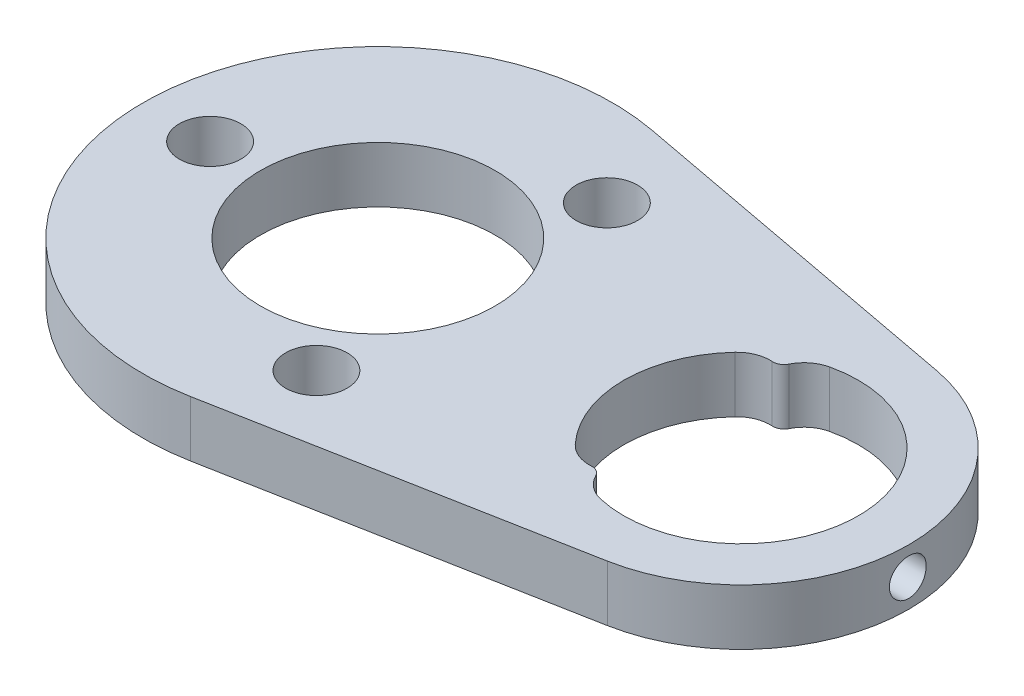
ISO-10303-21;
HEADER;
FILE_DESCRIPTION(('STEP AP214'),'2;1');
FILE_NAME('part.step','',(''),(''),'','','');
FILE_SCHEMA(('AUTOMOTIVE_DESIGN { 1 0 10303 214 1 1 1 1 }'));
ENDSEC;
DATA;
#1=APPLICATION_CONTEXT('core data for automotive mechanical design processes');
#2=APPLICATION_PROTOCOL_DEFINITION('international standard','automotive_design',2000,#1);
#3=PRODUCT_CONTEXT('',#1,'mechanical');
#4=PRODUCT('Part','Part','',(#3));
#5=PRODUCT_RELATED_PRODUCT_CATEGORY('part','',(#4));
#6=PRODUCT_DEFINITION_FORMATION('','',#4);
#7=PRODUCT_DEFINITION_CONTEXT('part definition',#1,'design');
#8=PRODUCT_DEFINITION('design','',#6,#7);
#9=PRODUCT_DEFINITION_SHAPE('','',#8);
#10=(LENGTH_UNIT() NAMED_UNIT(*) SI_UNIT(.MILLI.,.METRE.));
#11=(NAMED_UNIT(*) PLANE_ANGLE_UNIT() SI_UNIT($,.RADIAN.));
#12=(NAMED_UNIT(*) SI_UNIT($,.STERADIAN.) SOLID_ANGLE_UNIT());
#13=UNCERTAINTY_MEASURE_WITH_UNIT(LENGTH_MEASURE(1.E-05),#10,'distance_accuracy_value','');
#14=(GEOMETRIC_REPRESENTATION_CONTEXT(3) GLOBAL_UNCERTAINTY_ASSIGNED_CONTEXT((#13)) GLOBAL_UNIT_ASSIGNED_CONTEXT((#10,
#11,#12)) REPRESENTATION_CONTEXT('',''));
#15=CARTESIAN_POINT('',(0.,0.,0.));
#16=DIRECTION('',(0.,0.,1.));
#17=DIRECTION('',(1.,0.,0.));
#18=AXIS2_PLACEMENT_3D('',#15,#16,#17);
#19=CARTESIAN_POINT('',(0.,2.5,0.));
#20=DIRECTION('',(0.,1.,0.));
#21=DIRECTION('',(0.,0.,1.));
#22=AXIS2_PLACEMENT_3D('',#19,#20,#21);
#23=PLANE('',#22);
#24=CARTESIAN_POINT('',(7.49999999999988,2.5,-12.9903810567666));
#25=DIRECTION('',(0.,1.,0.));
#26=DIRECTION('',(0.,0.,1.));
#27=AXIS2_PLACEMENT_3D('',#24,#25,#26);
#28=CIRCLE('',#27,2.75);
#29=CARTESIAN_POINT('',(7.49999999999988,2.5,-10.2403810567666));
#30=VERTEX_POINT('',#29);
#31=EDGE_CURVE('E365',#30,#30,#28,.T.);
#32=ORIENTED_EDGE('',*,*,#31,.F.);
#33=EDGE_LOOP('',(#32));
#34=FACE_BOUND('',#33,.T.);
#35=CARTESIAN_POINT('',(7.50000000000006,2.5,12.9903810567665));
#36=DIRECTION('',(0.,1.,0.));
#37=DIRECTION('',(0.,0.,1.));
#38=AXIS2_PLACEMENT_3D('',#35,#36,#37);
#39=CIRCLE('',#38,2.75);
#40=CARTESIAN_POINT('',(7.50000000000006,2.5,15.7403810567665));
#41=VERTEX_POINT('',#40);
#42=EDGE_CURVE('E373',#41,#41,#39,.T.);
#43=ORIENTED_EDGE('',*,*,#42,.F.);
#44=EDGE_LOOP('',(#43));
#45=FACE_BOUND('',#44,.T.);
#46=CARTESIAN_POINT('',(-15.,2.5,0.));
#47=DIRECTION('',(0.,1.,0.));
#48=DIRECTION('',(0.,0.,1.));
#49=AXIS2_PLACEMENT_3D('',#46,#47,#48);
#50=CIRCLE('',#49,2.75);
#51=CARTESIAN_POINT('',(-15.,2.5,2.75));
#52=VERTEX_POINT('',#51);
#53=EDGE_CURVE('E379',#52,#52,#50,.T.);
#54=ORIENTED_EDGE('',*,*,#53,.F.);
#55=EDGE_LOOP('',(#54));
#56=FACE_BOUND('',#55,.T.);
#57=CARTESIAN_POINT('',(27.25,2.5,9.09326673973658));
#58=DIRECTION('',(0.,-1.,0.));
#59=DIRECTION('',(0.,0.,1.));
#60=AXIS2_PLACEMENT_3D('',#57,#58,#59);
#61=CIRCLE('',#60,1.);
#62=CARTESIAN_POINT('',(27.1879531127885,2.5,8.09519350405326));
#63=VERTEX_POINT('',#62);
#64=CARTESIAN_POINT('',(28.1453802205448,2.5,8.64796430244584));
#65=VERTEX_POINT('',#64);
#66=EDGE_CURVE('E249',#63,#65,#61,.T.);
#67=ORIENTED_EDGE('',*,*,#66,.F.);
#68=CARTESIAN_POINT('',(27.001812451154,2.5,5.10097379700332));
#69=DIRECTION('',(0.,1.,0.));
#70=DIRECTION('',(0.,0.,1.));
#71=AXIS2_PLACEMENT_3D('',#68,#69,#70);
#72=CIRCLE('',#71,3.);
#73=CARTESIAN_POINT('',(24.8025374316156,2.5,7.14136331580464));
#74=VERTEX_POINT('',#73);
#75=EDGE_CURVE('E65',#63,#74,#72,.F.);
#76=ORIENTED_EDGE('',*,*,#75,.T.);
#77=CARTESIAN_POINT('',(32.5,2.5,0.));
#78=DIRECTION('',(0.,1.,0.));
#79=DIRECTION('',(0.,0.,1.));
#80=AXIS2_PLACEMENT_3D('',#77,#78,#79);
#81=CIRCLE('',#80,10.5);
#82=CARTESIAN_POINT('',(24.8025374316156,2.5,-7.14136331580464));
#83=VERTEX_POINT('',#82);
#84=EDGE_CURVE('E238',#83,#74,#81,.T.);
#85=ORIENTED_EDGE('',*,*,#84,.F.);
#86=CARTESIAN_POINT('',(27.001812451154,2.5,-5.10097379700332));
#87=DIRECTION('',(0.,1.,0.));
#88=DIRECTION('',(0.,0.,1.));
#89=AXIS2_PLACEMENT_3D('',#86,#87,#88);
#90=CIRCLE('',#89,3.);
#91=CARTESIAN_POINT('',(27.1879531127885,2.5,-8.09519350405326));
#92=VERTEX_POINT('',#91);
#93=EDGE_CURVE('E211',#83,#92,#90,.F.);
#94=ORIENTED_EDGE('',*,*,#93,.T.);
#95=CARTESIAN_POINT('',(27.25,2.5,-9.09326673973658));
#96=DIRECTION('',(0.,-1.,0.));
#97=DIRECTION('',(0.,0.,1.));
#98=AXIS2_PLACEMENT_3D('',#95,#96,#97);
#99=CIRCLE('',#98,1.);
#100=CARTESIAN_POINT('',(28.1453802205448,2.5,-8.64796430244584));
#101=VERTEX_POINT('',#100);
#102=EDGE_CURVE('E245',#101,#92,#99,.T.);
#103=ORIENTED_EDGE('',*,*,#102,.F.);
#104=CARTESIAN_POINT('',(30.8315208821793,2.5,-7.3120569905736));
#105=DIRECTION('',(0.,1.,0.));
#106=DIRECTION('',(0.,0.,1.));
#107=AXIS2_PLACEMENT_3D('',#104,#105,#106);
#108=CIRCLE('',#107,3.);
#109=CARTESIAN_POINT('',(30.164129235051,2.5,-10.236879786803));
#110=VERTEX_POINT('',#109);
#111=EDGE_CURVE('E13',#101,#110,#108,.F.);
#112=ORIENTED_EDGE('',*,*,#111,.T.);
#113=CARTESIAN_POINT('',(32.5,2.5,0.));
#114=DIRECTION('',(0.,1.,0.));
#115=DIRECTION('',(0.,0.,1.));
#116=AXIS2_PLACEMENT_3D('',#113,#114,#115);
#117=CIRCLE('',#116,10.5);
#118=CARTESIAN_POINT('',(30.164129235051,2.5,10.236879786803));
#119=VERTEX_POINT('',#118);
#120=EDGE_CURVE('E243',#119,#110,#117,.T.);
#121=ORIENTED_EDGE('',*,*,#120,.F.);
#122=CARTESIAN_POINT('',(30.8315208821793,2.5,7.3120569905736));
#123=DIRECTION('',(0.,1.,0.));
#124=DIRECTION('',(0.,0.,1.));
#125=AXIS2_PLACEMENT_3D('',#122,#123,#124);
#126=CIRCLE('',#125,3.);
#127=EDGE_CURVE('E205',#119,#65,#126,.F.);
#128=ORIENTED_EDGE('',*,*,#127,.T.);
#129=EDGE_LOOP('',(#67,#76,#85,#94,#103,#112,#121,#128));
#130=FACE_BOUND('',#129,.T.);
#131=CARTESIAN_POINT('',(0.,2.5,0.));
#132=DIRECTION('',(0.,1.,0.));
#133=DIRECTION('',(0.,0.,1.));
#134=AXIS2_PLACEMENT_3D('',#131,#132,#133);
#135=CIRCLE('',#134,21.);
#136=CARTESIAN_POINT('',(3.87692307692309,2.5,-20.6390277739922));
#137=VERTEX_POINT('',#136);
#138=CARTESIAN_POINT('',(3.87692307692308,2.5,20.6390277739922));
#139=VERTEX_POINT('',#138);
#140=EDGE_CURVE('E152',#137,#139,#135,.T.);
#141=ORIENTED_EDGE('',*,*,#140,.T.);
#142=DIRECTION('',(0.982810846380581,0.,-0.184615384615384));
#143=VECTOR('',#142,1.);
#144=CARTESIAN_POINT('',(35.2692307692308,2.5,14.7421626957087));
#145=LINE('',#144,#143);
#146=CARTESIAN_POINT('',(35.2692307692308,2.5,14.7421626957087));
#147=VERTEX_POINT('',#146);
#148=EDGE_CURVE('E140',#139,#147,#145,.T.);
#149=ORIENTED_EDGE('',*,*,#148,.T.);
#150=CARTESIAN_POINT('',(32.5,2.5,0.));
#151=DIRECTION('',(0.,1.,0.));
#152=DIRECTION('',(0.,0.,1.));
#153=AXIS2_PLACEMENT_3D('',#150,#151,#152);
#154=CIRCLE('',#153,15.);
#155=CARTESIAN_POINT('',(35.2692307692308,2.5,-14.7421626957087));
#156=VERTEX_POINT('',#155);
#157=EDGE_CURVE('E151',#147,#156,#154,.T.);
#158=ORIENTED_EDGE('',*,*,#157,.T.);
#159=DIRECTION('',(-0.982810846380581,0.,-0.184615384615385));
#160=VECTOR('',#159,1.);
#161=CARTESIAN_POINT('',(3.87692307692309,2.5,-20.6390277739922));
#162=LINE('',#161,#160);
#163=EDGE_CURVE('E157',#156,#137,#162,.T.);
#164=ORIENTED_EDGE('',*,*,#163,.T.);
#165=EDGE_LOOP('',(#141,#149,#158,#164));
#166=FACE_BOUND('',#165,.T.);
#167=CARTESIAN_POINT('',(0.,2.5,0.));
#168=DIRECTION('',(0.,1.,0.));
#169=DIRECTION('',(0.,0.,1.));
#170=AXIS2_PLACEMENT_3D('',#167,#168,#169);
#171=CIRCLE('',#170,10.5);
#172=CARTESIAN_POINT('',(0.,2.5,10.5));
#173=VERTEX_POINT('',#172);
#174=EDGE_CURVE('E263',#173,#173,#171,.T.);
#175=ORIENTED_EDGE('',*,*,#174,.F.);
#176=EDGE_LOOP('',(#175));
#177=FACE_BOUND('',#176,.T.);
#178=ADVANCED_FACE('F49',(#34,#45,#56,#130,#166,#177),#23,.T.);
#179=CARTESIAN_POINT('',(0.,-2.5,0.));
#180=DIRECTION('',(0.,1.,0.));
#181=DIRECTION('',(0.,0.,1.));
#182=AXIS2_PLACEMENT_3D('',#179,#180,#181);
#183=PLANE('',#182);
#184=CARTESIAN_POINT('',(7.49999999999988,-2.5,-12.9903810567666));
#185=DIRECTION('',(0.,1.,0.));
#186=DIRECTION('',(0.,0.,1.));
#187=AXIS2_PLACEMENT_3D('',#184,#185,#186);
#188=CIRCLE('',#187,2.75);
#189=CARTESIAN_POINT('',(7.49999999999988,-2.5,-10.2403810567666));
#190=VERTEX_POINT('',#189);
#191=EDGE_CURVE('E369',#190,#190,#188,.T.);
#192=ORIENTED_EDGE('',*,*,#191,.T.);
#193=EDGE_LOOP('',(#192));
#194=FACE_BOUND('',#193,.T.);
#195=CARTESIAN_POINT('',(7.50000000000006,-2.5,12.9903810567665));
#196=DIRECTION('',(0.,1.,0.));
#197=DIRECTION('',(0.,0.,1.));
#198=AXIS2_PLACEMENT_3D('',#195,#196,#197);
#199=CIRCLE('',#198,2.75);
#200=CARTESIAN_POINT('',(7.50000000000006,-2.5,15.7403810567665));
#201=VERTEX_POINT('',#200);
#202=EDGE_CURVE('E376',#201,#201,#199,.T.);
#203=ORIENTED_EDGE('',*,*,#202,.T.);
#204=EDGE_LOOP('',(#203));
#205=FACE_BOUND('',#204,.T.);
#206=CARTESIAN_POINT('',(-15.,-2.5,0.));
#207=DIRECTION('',(0.,1.,0.));
#208=DIRECTION('',(0.,0.,1.));
#209=AXIS2_PLACEMENT_3D('',#206,#207,#208);
#210=CIRCLE('',#209,2.75);
#211=CARTESIAN_POINT('',(-15.,-2.5,2.75));
#212=VERTEX_POINT('',#211);
#213=EDGE_CURVE('E383',#212,#212,#210,.T.);
#214=ORIENTED_EDGE('',*,*,#213,.T.);
#215=EDGE_LOOP('',(#214));
#216=FACE_BOUND('',#215,.T.);
#217=CARTESIAN_POINT('',(0.,-2.5,0.));
#218=DIRECTION('',(0.,1.,0.));
#219=DIRECTION('',(0.,0.,1.));
#220=AXIS2_PLACEMENT_3D('',#217,#218,#219);
#221=CIRCLE('',#220,21.);
#222=CARTESIAN_POINT('',(3.87692307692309,-2.5,-20.6390277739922));
#223=VERTEX_POINT('',#222);
#224=CARTESIAN_POINT('',(3.87692307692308,-2.5,20.6390277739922));
#225=VERTEX_POINT('',#224);
#226=EDGE_CURVE('E166',#223,#225,#221,.T.);
#227=ORIENTED_EDGE('',*,*,#226,.F.);
#228=DIRECTION('',(-0.982810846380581,0.,-0.184615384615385));
#229=VECTOR('',#228,1.);
#230=CARTESIAN_POINT('',(3.87692307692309,-2.5,-20.6390277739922));
#231=LINE('',#230,#229);
#232=CARTESIAN_POINT('',(35.2692307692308,-2.5,-14.7421626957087));
#233=VERTEX_POINT('',#232);
#234=EDGE_CURVE('E162',#233,#223,#231,.T.);
#235=ORIENTED_EDGE('',*,*,#234,.F.);
#236=CARTESIAN_POINT('',(32.5,-2.5,0.));
#237=DIRECTION('',(0.,1.,0.));
#238=DIRECTION('',(0.,0.,1.));
#239=AXIS2_PLACEMENT_3D('',#236,#237,#238);
#240=CIRCLE('',#239,15.);
#241=CARTESIAN_POINT('',(35.2692307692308,-2.5,14.7421626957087));
#242=VERTEX_POINT('',#241);
#243=EDGE_CURVE('E279',#242,#233,#240,.T.);
#244=ORIENTED_EDGE('',*,*,#243,.F.);
#245=DIRECTION('',(0.982810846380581,0.,-0.184615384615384));
#246=VECTOR('',#245,1.);
#247=CARTESIAN_POINT('',(35.2692307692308,-2.5,14.7421626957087));
#248=LINE('',#247,#246);
#249=EDGE_CURVE('E276',#225,#242,#248,.T.);
#250=ORIENTED_EDGE('',*,*,#249,.F.);
#251=EDGE_LOOP('',(#227,#235,#244,#250));
#252=FACE_BOUND('',#251,.T.);
#253=CARTESIAN_POINT('',(27.25,-2.5,-9.09326673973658));
#254=DIRECTION('',(0.,-1.,0.));
#255=DIRECTION('',(0.,0.,1.));
#256=AXIS2_PLACEMENT_3D('',#253,#254,#255);
#257=CIRCLE('',#256,1.);
#258=CARTESIAN_POINT('',(28.1453802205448,-2.5,-8.64796430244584));
#259=VERTEX_POINT('',#258);
#260=CARTESIAN_POINT('',(27.1879531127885,-2.5,-8.09519350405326));
#261=VERTEX_POINT('',#260);
#262=EDGE_CURVE('E226',#259,#261,#257,.T.);
#263=ORIENTED_EDGE('',*,*,#262,.T.);
#264=CARTESIAN_POINT('',(27.001812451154,-2.5,-5.10097379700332));
#265=DIRECTION('',(0.,1.,0.));
#266=DIRECTION('',(0.,0.,1.));
#267=AXIS2_PLACEMENT_3D('',#264,#265,#266);
#268=CIRCLE('',#267,3.);
#269=CARTESIAN_POINT('',(24.8025374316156,-2.5,-7.14136331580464));
#270=VERTEX_POINT('',#269);
#271=EDGE_CURVE('E208',#261,#270,#268,.T.);
#272=ORIENTED_EDGE('',*,*,#271,.T.);
#273=CARTESIAN_POINT('',(32.5,-2.5,0.));
#274=DIRECTION('',(0.,1.,0.));
#275=DIRECTION('',(0.,0.,1.));
#276=AXIS2_PLACEMENT_3D('',#273,#274,#275);
#277=CIRCLE('',#276,10.5);
#278=CARTESIAN_POINT('',(24.8025374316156,-2.5,7.14136331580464));
#279=VERTEX_POINT('',#278);
#280=EDGE_CURVE('E258',#270,#279,#277,.T.);
#281=ORIENTED_EDGE('',*,*,#280,.T.);
#282=CARTESIAN_POINT('',(27.001812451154,-2.5,5.10097379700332));
#283=DIRECTION('',(0.,1.,0.));
#284=DIRECTION('',(0.,0.,1.));
#285=AXIS2_PLACEMENT_3D('',#282,#283,#284);
#286=CIRCLE('',#285,3.);
#287=CARTESIAN_POINT('',(27.1879531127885,-2.5,8.09519350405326));
#288=VERTEX_POINT('',#287);
#289=EDGE_CURVE('E214',#279,#288,#286,.T.);
#290=ORIENTED_EDGE('',*,*,#289,.T.);
#291=CARTESIAN_POINT('',(27.25,-2.5,9.09326673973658));
#292=DIRECTION('',(0.,-1.,0.));
#293=DIRECTION('',(0.,0.,1.));
#294=AXIS2_PLACEMENT_3D('',#291,#292,#293);
#295=CIRCLE('',#294,1.);
#296=CARTESIAN_POINT('',(28.1453802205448,-2.5,8.64796430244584));
#297=VERTEX_POINT('',#296);
#298=EDGE_CURVE('E262',#288,#297,#295,.T.);
#299=ORIENTED_EDGE('',*,*,#298,.T.);
#300=CARTESIAN_POINT('',(30.8315208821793,-2.5,7.3120569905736));
#301=DIRECTION('',(0.,1.,0.));
#302=DIRECTION('',(0.,0.,1.));
#303=AXIS2_PLACEMENT_3D('',#300,#301,#302);
#304=CIRCLE('',#303,3.);
#305=CARTESIAN_POINT('',(30.164129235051,-2.5,10.236879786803));
#306=VERTEX_POINT('',#305);
#307=EDGE_CURVE('E202',#297,#306,#304,.T.);
#308=ORIENTED_EDGE('',*,*,#307,.T.);
#309=CARTESIAN_POINT('',(32.5,-2.5,0.));
#310=DIRECTION('',(0.,1.,0.));
#311=DIRECTION('',(0.,0.,1.));
#312=AXIS2_PLACEMENT_3D('',#309,#310,#311);
#313=CIRCLE('',#312,10.5);
#314=CARTESIAN_POINT('',(30.164129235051,-2.5,-10.236879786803));
#315=VERTEX_POINT('',#314);
#316=EDGE_CURVE('E228',#306,#315,#313,.T.);
#317=ORIENTED_EDGE('',*,*,#316,.T.);
#318=CARTESIAN_POINT('',(30.8315208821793,-2.5,-7.3120569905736));
#319=DIRECTION('',(0.,1.,0.));
#320=DIRECTION('',(0.,0.,1.));
#321=AXIS2_PLACEMENT_3D('',#318,#319,#320);
#322=CIRCLE('',#321,3.);
#323=EDGE_CURVE('E58',#315,#259,#322,.T.);
#324=ORIENTED_EDGE('',*,*,#323,.T.);
#325=EDGE_LOOP('',(#263,#272,#281,#290,#299,#308,#317,#324));
#326=FACE_BOUND('',#325,.T.);
#327=CARTESIAN_POINT('',(0.,-2.5,0.));
#328=DIRECTION('',(0.,1.,0.));
#329=DIRECTION('',(0.,0.,1.));
#330=AXIS2_PLACEMENT_3D('',#327,#328,#329);
#331=CIRCLE('',#330,10.5);
#332=CARTESIAN_POINT('',(0.,-2.5,10.5));
#333=VERTEX_POINT('',#332);
#334=EDGE_CURVE('E387',#333,#333,#331,.T.);
#335=ORIENTED_EDGE('',*,*,#334,.T.);
#336=EDGE_LOOP('',(#335));
#337=FACE_BOUND('',#336,.T.);
#338=ADVANCED_FACE('F224',(#194,#205,#216,#252,#326,#337),#183,.F.);
#339=CARTESIAN_POINT('',(0.,2.5,0.));
#340=DIRECTION('',(0.,-1.,0.));
#341=DIRECTION('',(0.,0.,-1.));
#342=AXIS2_PLACEMENT_3D('',#339,#340,#341);
#343=CYLINDRICAL_SURFACE('',#342,21.);
#344=ORIENTED_EDGE('',*,*,#226,.T.);
#345=DIRECTION('',(0.,-1.,0.));
#346=VECTOR('',#345,1.);
#347=CARTESIAN_POINT('',(3.87692307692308,2.5,20.6390277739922));
#348=LINE('',#347,#346);
#349=EDGE_CURVE('E144',#139,#225,#348,.T.);
#350=ORIENTED_EDGE('',*,*,#349,.F.);
#351=ORIENTED_EDGE('',*,*,#140,.F.);
#352=DIRECTION('',(0.,-1.,0.));
#353=VECTOR('',#352,1.);
#354=CARTESIAN_POINT('',(3.87692307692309,2.5,-20.6390277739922));
#355=LINE('',#354,#353);
#356=EDGE_CURVE('E273',#137,#223,#355,.T.);
#357=ORIENTED_EDGE('',*,*,#356,.T.);
#358=EDGE_LOOP('',(#344,#350,#351,#357));
#359=FACE_BOUND('',#358,.T.);
#360=ADVANCED_FACE('F164',(#359),#343,.T.);
#361=CARTESIAN_POINT('',(35.2692307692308,2.5,14.7421626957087));
#362=DIRECTION('',(-0.184615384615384,0.,-0.982810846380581));
#363=DIRECTION('',(-0.982810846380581,0.,0.184615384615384));
#364=AXIS2_PLACEMENT_3D('',#361,#362,#363);
#365=PLANE('',#364);
#366=ORIENTED_EDGE('',*,*,#249,.T.);
#367=DIRECTION('',(0.,-1.,0.));
#368=VECTOR('',#367,1.);
#369=CARTESIAN_POINT('',(35.2692307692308,2.5,14.7421626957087));
#370=LINE('',#369,#368);
#371=EDGE_CURVE('E147',#147,#242,#370,.T.);
#372=ORIENTED_EDGE('',*,*,#371,.F.);
#373=ORIENTED_EDGE('',*,*,#148,.F.);
#374=ORIENTED_EDGE('',*,*,#349,.T.);
#375=EDGE_LOOP('',(#366,#372,#373,#374));
#376=FACE_BOUND('',#375,.T.);
#377=ADVANCED_FACE('F142',(#376),#365,.F.);
#378=CARTESIAN_POINT('',(32.5,2.5,0.));
#379=DIRECTION('',(0.,-1.,0.));
#380=DIRECTION('',(0.,0.,-1.));
#381=AXIS2_PLACEMENT_3D('',#378,#379,#380);
#382=CYLINDRICAL_SURFACE('',#381,15.);
#383=CARTESIAN_POINT('',(47.4089738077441,0.,-1.64999999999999));
#384=CARTESIAN_POINT('',(47.4089749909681,-0.0923799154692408,-1.64999602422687));
#385=CARTESIAN_POINT('',(47.4098416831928,-0.184819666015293,-1.64221562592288));
#386=CARTESIAN_POINT('',(47.4132140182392,-0.367132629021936,-1.61129765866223));
#387=CARTESIAN_POINT('',(47.4157214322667,-0.457002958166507,-1.58814349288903));
#388=CARTESIAN_POINT('',(47.4220878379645,-0.631510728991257,-1.52716354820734));
#389=CARTESIAN_POINT('',(47.4259459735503,-0.716151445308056,-1.48934706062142));
#390=CARTESIAN_POINT('',(47.4345780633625,-0.877867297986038,-1.40013459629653));
#391=CARTESIAN_POINT('',(47.4393518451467,-0.954943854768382,-1.34874117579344));
#392=CARTESIAN_POINT('',(47.4493006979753,-1.09969747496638,-1.23359287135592));
#393=CARTESIAN_POINT('',(47.4544772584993,-1.16733678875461,-1.16979065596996));
#394=CARTESIAN_POINT('',(47.464634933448,-1.290970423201,-1.03173737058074));
#395=CARTESIAN_POINT('',(47.4696160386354,-1.3469641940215,-0.957485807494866));
#396=CARTESIAN_POINT('',(47.478836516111,-1.44584988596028,-0.800407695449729));
#397=CARTESIAN_POINT('',(47.4830739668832,-1.48870807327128,-0.717559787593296));
#398=CARTESIAN_POINT('',(47.4903134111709,-1.55989011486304,-0.545788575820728));
#399=CARTESIAN_POINT('',(47.4933154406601,-1.58821439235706,-0.456865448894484));
#400=CARTESIAN_POINT('',(47.4977353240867,-1.62941298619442,-0.275851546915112));
#401=CARTESIAN_POINT('',(47.4991595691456,-1.64234964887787,-0.183775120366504));
#402=CARTESIAN_POINT('',(47.5002851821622,-1.65259881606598,0.0012522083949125));
#403=CARTESIAN_POINT('',(47.4999866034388,-1.64991180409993,0.0942030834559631));
#404=CARTESIAN_POINT('',(47.4977054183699,-1.62904026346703,0.277917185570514));
#405=CARTESIAN_POINT('',(47.4957300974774,-1.61092277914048,0.368688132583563));
#406=CARTESIAN_POINT('',(47.4903256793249,-1.5598091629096,0.545893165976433));
#407=CARTESIAN_POINT('',(47.486896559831,-1.5268128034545,0.632327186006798));
#408=CARTESIAN_POINT('',(47.4789574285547,-1.44680540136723,0.798614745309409));
#409=CARTESIAN_POINT('',(47.4744451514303,-1.39976493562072,0.878454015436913));
#410=CARTESIAN_POINT('',(47.4648454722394,-1.29302600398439,1.02913004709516));
#411=CARTESIAN_POINT('',(47.4597580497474,-1.23332708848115,1.0999664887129));
#412=CARTESIAN_POINT('',(47.4495466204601,-1.1025894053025,1.23101921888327));
#413=CARTESIAN_POINT('',(47.4444225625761,-1.031492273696,1.29117729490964));
#414=CARTESIAN_POINT('',(47.4347421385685,-0.880177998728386,1.39871429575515));
#415=CARTESIAN_POINT('',(47.4301857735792,-0.799960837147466,1.44609319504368));
#416=CARTESIAN_POINT('',(47.4221564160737,-0.632636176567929,1.52672798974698));
#417=CARTESIAN_POINT('',(47.4186837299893,-0.545526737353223,1.55997989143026));
#418=CARTESIAN_POINT('',(47.4132211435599,-0.366914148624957,1.61136865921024));
#419=CARTESIAN_POINT('',(47.4112311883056,-0.275411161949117,1.62950608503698));
#420=CARTESIAN_POINT('',(47.4089691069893,-0.0911211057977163,1.65007534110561));
#421=CARTESIAN_POINT('',(47.4086880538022,0.00165674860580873,1.65258879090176));
#422=CARTESIAN_POINT('',(47.409852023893,0.186312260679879,1.64205347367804));
#423=CARTESIAN_POINT('',(47.4112970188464,0.278189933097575,1.62900496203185));
#424=CARTESIAN_POINT('',(47.4157421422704,0.458196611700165,1.58778457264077));
#425=CARTESIAN_POINT('',(47.4187382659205,0.546334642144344,1.55965163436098));
#426=CARTESIAN_POINT('',(47.4259448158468,0.716641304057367,1.48910085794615));
#427=CARTESIAN_POINT('',(47.4301552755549,0.798809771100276,1.44668262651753));
#428=CARTESIAN_POINT('',(47.439337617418,0.955215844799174,1.34856231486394));
#429=CARTESIAN_POINT('',(47.4443125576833,1.02941947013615,1.29280635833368));
#430=CARTESIAN_POINT('',(47.4544534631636,1.16744410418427,1.16967012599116));
#431=CARTESIAN_POINT('',(47.4596194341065,1.23126480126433,1.10228950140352));
#432=CARTESIAN_POINT('',(47.469587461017,1.3469953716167,0.957461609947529));
#433=CARTESIAN_POINT('',(47.4743878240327,1.39885185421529,0.879971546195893));
#434=CARTESIAN_POINT('',(47.48305888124,1.48881382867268,0.717334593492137));
#435=CARTESIAN_POINT('',(47.4869295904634,1.5269195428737,0.6321878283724));
#436=CARTESIAN_POINT('',(47.4932976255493,1.58820868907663,0.456837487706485));
#437=CARTESIAN_POINT('',(47.4957978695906,1.61142384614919,0.366645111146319));
#438=CARTESIAN_POINT('',(47.4991552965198,1.64237630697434,0.183613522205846));
#439=CARTESIAN_POINT('',(47.5000125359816,1.65011414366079,0.0907744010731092));
#440=CARTESIAN_POINT('',(47.4999872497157,1.64988390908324,-0.0943920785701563));
#441=CARTESIAN_POINT('',(47.4991138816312,1.64199850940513,-0.186719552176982));
#442=CARTESIAN_POINT('',(47.4957436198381,1.61091964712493,-0.368729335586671));
#443=CARTESIAN_POINT('',(47.4932467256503,1.58772618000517,-0.458411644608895));
#444=CARTESIAN_POINT('',(47.4869089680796,1.52671364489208,-0.632580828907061));
#445=CARTESIAN_POINT('',(47.4830683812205,1.48889758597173,-0.717068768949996));
#446=CARTESIAN_POINT('',(47.474470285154,1.39972197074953,-0.878511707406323));
#447=CARTESIAN_POINT('',(47.4697127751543,1.34836240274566,-0.95546669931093));
#448=CARTESIAN_POINT('',(47.4597829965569,1.23324894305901,-1.10008263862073));
#449=CARTESIAN_POINT('',(47.4546087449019,1.16943345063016,-1.16769441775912));
#450=CARTESIAN_POINT('',(47.4444451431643,1.0313444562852,-1.29128435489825));
#451=CARTESIAN_POINT('',(47.4394558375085,0.957068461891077,-1.34725973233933));
#452=CARTESIAN_POINT('',(47.4302109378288,0.799915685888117,-1.44612652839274));
#453=CARTESIAN_POINT('',(47.4259576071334,0.71701358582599,-1.48897788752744));
#454=CARTESIAN_POINT('',(47.418692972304,0.545194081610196,-1.56009276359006));
#455=CARTESIAN_POINT('',(47.4156802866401,0.456283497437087,-1.58837251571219));
#456=CARTESIAN_POINT('',(47.4119873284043,0.305737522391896,-1.62259384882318));
#457=CARTESIAN_POINT('',(47.4108627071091,0.245060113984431,-1.63285683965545));
#458=CARTESIAN_POINT('',(47.4093555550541,0.122930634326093,-1.64656121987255));
#459=CARTESIAN_POINT('',(47.408973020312,0.0614785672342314,-1.65000264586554));
#460=CARTESIAN_POINT('',(47.4089738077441,0.,-1.64999999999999));
#461=B_SPLINE_CURVE_WITH_KNOTS('',3,(#383,#384,#385,#386,#387,#388,#389,#390,#391,#392,#393,
#394,#395,#396,#397,#398,#399,#400,#401,#402,#403,#404,#405,#406,#407,#408,#409,#410,#411,#412,
#413,#414,#415,#416,#417,#418,#419,#420,#421,#422,#423,#424,#425,#426,#427,#428,#429,#430,#431,
#432,#433,#434,#435,#436,#437,#438,#439,#440,#441,#442,#443,#444,#445,#446,#447,#448,#449,#450,
#451,#452,#453,#454,#455,#456,#457,#458,#459,#460),.UNSPECIFIED.,.T.,.F.,(4,2,2,2,2,2,2,2,2,2,2,
2,2,2,2,2,2,2,2,2,2,2,2,2,2,2,2,2,2,2,2,2,2,2,2,2,2,2,4),(0.,0.276915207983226,
0.554129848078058,0.831169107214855,1.10815624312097,1.38622139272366,1.66429966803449,
1.94308621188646,2.2218646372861,2.49950964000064,2.77714605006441,3.0535822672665,
3.33002271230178,3.60704642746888,3.8840799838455,4.16258025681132,4.44108108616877,
4.71966059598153,4.99822978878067,5.27534250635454,5.5524506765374,5.82884692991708,
6.10525079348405,6.3827905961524,6.66033872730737,6.93910245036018,7.21786166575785,
7.49602498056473,7.77417871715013,8.05086451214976,8.3275503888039,8.60417935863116,
8.88080856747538,9.15884219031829,9.43694217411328,9.71588275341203,9.99451187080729,
10.1787991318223,10.3630854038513),.UNSPECIFIED.);
#462=CARTESIAN_POINT('',(47.4089738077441,0.,-1.64999999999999));
#463=VERTEX_POINT('',#462);
#464=EDGE_CURVE('E359',#463,#463,#461,.T.);
#465=ORIENTED_EDGE('',*,*,#464,.T.);
#466=EDGE_LOOP('',(#465));
#467=FACE_BOUND('',#466,.T.);
#468=ORIENTED_EDGE('',*,*,#243,.T.);
#469=DIRECTION('',(0.,-1.,0.));
#470=VECTOR('',#469,1.);
#471=CARTESIAN_POINT('',(35.2692307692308,2.5,-14.7421626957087));
#472=LINE('',#471,#470);
#473=EDGE_CURVE('E176',#156,#233,#472,.T.);
#474=ORIENTED_EDGE('',*,*,#473,.F.);
#475=ORIENTED_EDGE('',*,*,#157,.F.);
#476=ORIENTED_EDGE('',*,*,#371,.T.);
#477=EDGE_LOOP('',(#468,#474,#475,#476));
#478=FACE_BOUND('',#477,.T.);
#479=ADVANCED_FACE('F295',(#467,#478),#382,.T.);
#480=CARTESIAN_POINT('',(3.87692307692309,2.5,-20.6390277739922));
#481=DIRECTION('',(-0.184615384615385,0.,0.982810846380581));
#482=DIRECTION('',(0.982810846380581,0.,0.184615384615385));
#483=AXIS2_PLACEMENT_3D('',#480,#481,#482);
#484=PLANE('',#483);
#485=ORIENTED_EDGE('',*,*,#234,.T.);
#486=ORIENTED_EDGE('',*,*,#356,.F.);
#487=ORIENTED_EDGE('',*,*,#163,.F.);
#488=ORIENTED_EDGE('',*,*,#473,.T.);
#489=EDGE_LOOP('',(#485,#486,#487,#488));
#490=FACE_BOUND('',#489,.T.);
#491=ADVANCED_FACE('F291',(#490),#484,.F.);
#492=CARTESIAN_POINT('',(32.5,2.5,0.));
#493=DIRECTION('',(0.,-1.,0.));
#494=DIRECTION('',(0.,0.,-1.));
#495=AXIS2_PLACEMENT_3D('',#492,#493,#494);
#496=CYLINDRICAL_SURFACE('',#495,10.5);
#497=ORIENTED_EDGE('',*,*,#280,.F.);
#498=DIRECTION('',(0.,-1.,0.));
#499=VECTOR('',#498,1.);
#500=CARTESIAN_POINT('',(24.8025374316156,2.5,-7.14136331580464));
#501=LINE('',#500,#499);
#502=EDGE_CURVE('E72',#270,#83,#501,.F.);
#503=ORIENTED_EDGE('',*,*,#502,.T.);
#504=ORIENTED_EDGE('',*,*,#84,.T.);
#505=DIRECTION('',(0.,-1.,0.));
#506=VECTOR('',#505,1.);
#507=CARTESIAN_POINT('',(24.8025374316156,2.5,7.14136331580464));
#508=LINE('',#507,#506);
#509=EDGE_CURVE('E197',#74,#279,#508,.T.);
#510=ORIENTED_EDGE('',*,*,#509,.T.);
#511=EDGE_LOOP('',(#497,#503,#504,#510));
#512=FACE_BOUND('',#511,.T.);
#513=ADVANCED_FACE('F303',(#512),#496,.F.);
#514=CARTESIAN_POINT('',(27.25,2.5,9.09326673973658));
#515=DIRECTION('',(0.,-1.,0.));
#516=DIRECTION('',(0.,0.,-1.));
#517=AXIS2_PLACEMENT_3D('',#514,#515,#516);
#518=CYLINDRICAL_SURFACE('',#517,1.);
#519=ORIENTED_EDGE('',*,*,#66,.T.);
#520=DIRECTION('',(0.,-1.,0.));
#521=VECTOR('',#520,1.);
#522=CARTESIAN_POINT('',(28.1453802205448,2.5,8.64796430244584));
#523=LINE('',#522,#521);
#524=EDGE_CURVE('E173',#65,#297,#523,.T.);
#525=ORIENTED_EDGE('',*,*,#524,.T.);
#526=ORIENTED_EDGE('',*,*,#298,.F.);
#527=DIRECTION('',(0.,-1.,0.));
#528=VECTOR('',#527,1.);
#529=CARTESIAN_POINT('',(27.1879531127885,2.5,8.09519350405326));
#530=LINE('',#529,#528);
#531=EDGE_CURVE('E168',#288,#63,#530,.F.);
#532=ORIENTED_EDGE('',*,*,#531,.T.);
#533=EDGE_LOOP('',(#519,#525,#526,#532));
#534=FACE_BOUND('',#533,.T.);
#535=ADVANCED_FACE('F321',(#534),#518,.T.);
#536=CARTESIAN_POINT('',(32.5,2.5,0.));
#537=DIRECTION('',(0.,-1.,0.));
#538=DIRECTION('',(0.,0.,-1.));
#539=AXIS2_PLACEMENT_3D('',#536,#537,#538);
#540=CYLINDRICAL_SURFACE('',#539,10.5);
#541=CARTESIAN_POINT('',(42.8695467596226,0.,-1.64999999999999));
#542=CARTESIAN_POINT('',(42.8695483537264,-0.0920652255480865,-1.64999623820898));
#543=CARTESIAN_POINT('',(42.8707861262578,-0.184182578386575,-1.64226846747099));
#544=CARTESIAN_POINT('',(42.8755996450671,-0.365837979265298,-1.61157194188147));
#545=CARTESIAN_POINT('',(42.8791776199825,-0.455373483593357,-1.58858865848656));
#546=CARTESIAN_POINT('',(42.8882565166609,-0.629209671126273,-1.52808896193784));
#547=CARTESIAN_POINT('',(42.8937559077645,-0.713514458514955,-1.49058411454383));
#548=CARTESIAN_POINT('',(42.9060561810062,-0.874623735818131,-1.40213382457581));
#549=CARTESIAN_POINT('',(42.9128568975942,-0.951429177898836,-1.35119009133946));
#550=CARTESIAN_POINT('',(42.9270602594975,-1.09604428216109,-1.23683095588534));
#551=CARTESIAN_POINT('',(42.9344672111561,-1.16377858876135,-1.17332078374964));
#552=CARTESIAN_POINT('',(42.9490101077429,-1.28767504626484,-1.03583631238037));
#553=CARTESIAN_POINT('',(42.9561460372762,-1.34383654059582,-0.961861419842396));
#554=CARTESIAN_POINT('',(42.9693881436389,-1.44327323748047,-0.805062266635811));
#555=CARTESIAN_POINT('',(42.9754886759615,-1.48647873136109,-0.72219328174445));
#556=CARTESIAN_POINT('',(42.985924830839,-1.55832934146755,-0.550262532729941));
#557=CARTESIAN_POINT('',(42.9902605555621,-1.5869753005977,-0.461201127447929));
#558=CARTESIAN_POINT('',(42.9966481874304,-1.62866437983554,-0.280190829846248));
#559=CARTESIAN_POINT('',(42.9987185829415,-1.64183387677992,-0.188271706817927));
#560=CARTESIAN_POINT('',(43.0004057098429,-1.65258884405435,-0.00350664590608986));
#561=CARTESIAN_POINT('',(43.0000225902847,-1.6501752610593,0.0893392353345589));
#562=CARTESIAN_POINT('',(42.9968605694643,-1.62993182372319,0.27245926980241));
#563=CARTESIAN_POINT('',(42.9941028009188,-1.61223794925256,0.362748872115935));
#564=CARTESIAN_POINT('',(42.9865248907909,-1.56214991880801,0.539061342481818));
#565=CARTESIAN_POINT('',(42.981704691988,-1.52975535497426,0.625084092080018));
#566=CARTESIAN_POINT('',(42.9705073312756,-1.45104799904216,0.790829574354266));
#567=CARTESIAN_POINT('',(42.9641238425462,-1.40467846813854,0.870524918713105));
#568=CARTESIAN_POINT('',(42.9505104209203,-1.29937892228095,1.02105474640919));
#569=CARTESIAN_POINT('',(42.9432804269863,-1.24044800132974,1.09188859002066));
#570=CARTESIAN_POINT('',(42.9286872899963,-1.11094236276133,1.22348704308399));
#571=CARTESIAN_POINT('',(42.9213235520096,-1.04024886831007,1.28413475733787));
#572=CARTESIAN_POINT('',(42.9073686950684,-0.889626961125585,1.39272520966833));
#573=CARTESIAN_POINT('',(42.900777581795,-0.8096984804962,1.44066785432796));
#574=CARTESIAN_POINT('',(42.8891142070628,-0.642747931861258,1.52250602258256));
#575=CARTESIAN_POINT('',(42.8840433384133,-0.555719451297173,1.55638867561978));
#576=CARTESIAN_POINT('',(42.8760185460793,-0.377109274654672,1.60902291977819));
#577=CARTESIAN_POINT('',(42.8730644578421,-0.285527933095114,1.62777568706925));
#578=CARTESIAN_POINT('',(42.8696391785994,-0.101454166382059,1.64945573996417));
#579=CARTESIAN_POINT('',(42.8691419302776,-0.00898177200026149,1.65254911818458));
#580=CARTESIAN_POINT('',(42.870617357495,0.17516027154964,1.64326409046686));
#581=CARTESIAN_POINT('',(42.8725899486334,0.26682994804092,1.63088621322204));
#582=CARTESIAN_POINT('',(42.8787587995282,0.446244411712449,1.59115121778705));
#583=CARTESIAN_POINT('',(42.8829426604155,0.53400815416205,1.56387759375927));
#584=CARTESIAN_POINT('',(42.8930523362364,0.703718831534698,1.49521245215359));
#585=CARTESIAN_POINT('',(42.8989782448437,0.785665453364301,1.45382017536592));
#586=CARTESIAN_POINT('',(42.9119653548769,0.9421580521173,1.35769658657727));
#587=CARTESIAN_POINT('',(42.9190355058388,1.01663750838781,1.30285820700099));
#588=CARTESIAN_POINT('',(42.9334878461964,1.15539613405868,1.18154712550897));
#589=CARTESIAN_POINT('',(42.940870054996,1.21967466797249,1.11507369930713));
#590=CARTESIAN_POINT('',(42.9551965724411,1.33680747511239,0.971646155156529));
#591=CARTESIAN_POINT('',(42.9621362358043,1.38955138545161,0.894601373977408));
#592=CARTESIAN_POINT('',(42.9747226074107,1.48134711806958,0.732648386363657));
#593=CARTESIAN_POINT('',(42.9803693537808,1.52039934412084,0.647740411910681));
#594=CARTESIAN_POINT('',(42.9897133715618,1.58352872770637,0.47280885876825));
#595=CARTESIAN_POINT('',(42.9934183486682,1.60766514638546,0.382807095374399));
#596=CARTESIAN_POINT('',(42.9984938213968,1.64046917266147,0.199965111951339));
#597=CARTESIAN_POINT('',(42.9998644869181,1.64913790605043,0.107125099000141));
#598=CARTESIAN_POINT('',(43.0001149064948,1.65073096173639,-0.0776897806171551));
#599=CARTESIAN_POINT('',(42.9990213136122,1.64382375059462,-0.169663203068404));
#600=CARTESIAN_POINT('',(42.9945201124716,1.61482345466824,-0.351123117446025));
#601=CARTESIAN_POINT('',(42.9911125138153,1.59273043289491,-0.440609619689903));
#602=CARTESIAN_POINT('',(42.982364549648,1.53404748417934,-0.614501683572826));
#603=CARTESIAN_POINT('',(42.9770258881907,1.49747033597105,-0.698911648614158));
#604=CARTESIAN_POINT('',(42.9650006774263,1.41087570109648,-0.860422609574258));
#605=CARTESIAN_POINT('',(42.9583140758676,1.36085769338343,-0.937523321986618));
#606=CARTESIAN_POINT('',(42.9442495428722,1.24819692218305,-1.08307928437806));
#607=CARTESIAN_POINT('',(42.9368652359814,1.18543018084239,-1.15143796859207));
#608=CARTESIAN_POINT('',(42.9222834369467,1.04931440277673,-1.27671290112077));
#609=CARTESIAN_POINT('',(42.9150859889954,0.975962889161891,-1.33362646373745));
#610=CARTESIAN_POINT('',(42.9016447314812,0.820221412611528,-1.43471641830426));
#611=CARTESIAN_POINT('',(42.8954071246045,0.737778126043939,-1.47881147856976));
#612=CARTESIAN_POINT('',(42.8846647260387,0.566593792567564,-1.55246117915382));
#613=CARTESIAN_POINT('',(42.8801581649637,0.477859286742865,-1.58203067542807));
#614=CARTESIAN_POINT('',(42.8744120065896,0.323956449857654,-1.61919880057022));
#615=CARTESIAN_POINT('',(42.8725974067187,0.259731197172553,-1.63073122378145));
#616=CARTESIAN_POINT('',(42.8701642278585,0.130345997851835,-1.64613309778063));
#617=CARTESIAN_POINT('',(42.8695456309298,0.0651860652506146,-1.6500026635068));
#618=CARTESIAN_POINT('',(42.8695467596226,0.,-1.64999999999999));
#619=B_SPLINE_CURVE_WITH_KNOTS('',3,(#541,#542,#543,#544,#545,#546,#547,#548,#549,#550,#551,
#552,#553,#554,#555,#556,#557,#558,#559,#560,#561,#562,#563,#564,#565,#566,#567,#568,#569,#570,
#571,#572,#573,#574,#575,#576,#577,#578,#579,#580,#581,#582,#583,#584,#585,#586,#587,#588,#589,
#590,#591,#592,#593,#594,#595,#596,#597,#598,#599,#600,#601,#602,#603,#604,#605,#606,#607,#608,
#609,#610,#611,#612,#613,#614,#615,#616,#617,#618),.UNSPECIFIED.,.T.,.F.,(4,2,2,2,2,2,2,2,2,2,2,
2,2,2,2,2,2,2,2,2,2,2,2,2,2,2,2,2,2,2,2,2,2,2,2,2,2,2,4),(0.,0.27595736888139,0.55217792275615,
0.828178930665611,1.10414484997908,1.38227725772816,1.66042544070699,1.94004437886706,
2.21964712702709,2.49695048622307,2.77423699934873,3.04908106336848,3.32393275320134,
3.59991573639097,3.87591863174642,4.15489963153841,4.43388268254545,4.71312055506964,
4.99233671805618,5.2685850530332,5.54482394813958,5.81953011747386,6.09425106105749,
6.37123493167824,6.64823605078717,6.92778160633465,7.20731891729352,7.48573835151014,
7.76413752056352,8.03954003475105,8.31494140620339,8.59010034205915,8.86526994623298,
9.14325598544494,9.42130718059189,9.70108588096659,9.98057784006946,10.1759702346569,
10.371359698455),.UNSPECIFIED.);
#620=CARTESIAN_POINT('',(42.8695467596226,0.,-1.64999999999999));
#621=VERTEX_POINT('',#620);
#622=EDGE_CURVE('E352',#621,#621,#619,.T.);
#623=ORIENTED_EDGE('',*,*,#622,.F.);
#624=EDGE_LOOP('',(#623));
#625=FACE_BOUND('',#624,.T.);
#626=ORIENTED_EDGE('',*,*,#316,.F.);
#627=DIRECTION('',(0.,-1.,0.));
#628=VECTOR('',#627,1.);
#629=CARTESIAN_POINT('',(30.164129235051,2.5,10.236879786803));
#630=LINE('',#629,#628);
#631=EDGE_CURVE('E187',#306,#119,#630,.F.);
#632=ORIENTED_EDGE('',*,*,#631,.T.);
#633=ORIENTED_EDGE('',*,*,#120,.T.);
#634=DIRECTION('',(0.,-1.,0.));
#635=VECTOR('',#634,1.);
#636=CARTESIAN_POINT('',(30.164129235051,2.5,-10.236879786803));
#637=LINE('',#636,#635);
#638=EDGE_CURVE('E183',#110,#315,#637,.T.);
#639=ORIENTED_EDGE('',*,*,#638,.T.);
#640=EDGE_LOOP('',(#626,#632,#633,#639));
#641=FACE_BOUND('',#640,.T.);
#642=ADVANCED_FACE('F247',(#625,#641),#540,.F.);
#643=CARTESIAN_POINT('',(27.25,2.5,-9.09326673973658));
#644=DIRECTION('',(0.,-1.,0.));
#645=DIRECTION('',(0.,0.,-1.));
#646=AXIS2_PLACEMENT_3D('',#643,#644,#645);
#647=CYLINDRICAL_SURFACE('',#646,1.);
#648=ORIENTED_EDGE('',*,*,#102,.T.);
#649=DIRECTION('',(0.,-1.,0.));
#650=VECTOR('',#649,1.);
#651=CARTESIAN_POINT('',(27.1879531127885,2.5,-8.09519350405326));
#652=LINE('',#651,#650);
#653=EDGE_CURVE('E193',#92,#261,#652,.T.);
#654=ORIENTED_EDGE('',*,*,#653,.T.);
#655=ORIENTED_EDGE('',*,*,#262,.F.);
#656=DIRECTION('',(0.,-1.,0.));
#657=VECTOR('',#656,1.);
#658=CARTESIAN_POINT('',(28.1453802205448,2.5,-8.64796430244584));
#659=LINE('',#658,#657);
#660=EDGE_CURVE('E190',#259,#101,#659,.F.);
#661=ORIENTED_EDGE('',*,*,#660,.T.);
#662=EDGE_LOOP('',(#648,#654,#655,#661));
#663=FACE_BOUND('',#662,.T.);
#664=ADVANCED_FACE('F234',(#663),#647,.T.);
#665=CARTESIAN_POINT('',(0.,2.5,0.));
#666=DIRECTION('',(0.,-1.,0.));
#667=DIRECTION('',(0.,0.,-1.));
#668=AXIS2_PLACEMENT_3D('',#665,#666,#667);
#669=CYLINDRICAL_SURFACE('',#668,10.5);
#670=ORIENTED_EDGE('',*,*,#174,.T.);
#671=EDGE_LOOP('',(#670));
#672=FACE_BOUND('',#671,.T.);
#673=ORIENTED_EDGE('',*,*,#334,.F.);
#674=EDGE_LOOP('',(#673));
#675=FACE_BOUND('',#674,.T.);
#676=ADVANCED_FACE('F330',(#672,#675),#669,.F.);
#677=CARTESIAN_POINT('',(30.8315208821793,2.5,7.3120569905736));
#678=DIRECTION('',(0.,-1.,0.));
#679=DIRECTION('',(0.,0.,-1.));
#680=AXIS2_PLACEMENT_3D('',#677,#678,#679);
#681=CYLINDRICAL_SURFACE('',#680,3.);
#682=ORIENTED_EDGE('',*,*,#127,.F.);
#683=ORIENTED_EDGE('',*,*,#631,.F.);
#684=ORIENTED_EDGE('',*,*,#307,.F.);
#685=ORIENTED_EDGE('',*,*,#524,.F.);
#686=EDGE_LOOP('',(#682,#683,#684,#685));
#687=FACE_BOUND('',#686,.T.);
#688=ADVANCED_FACE('F333',(#687),#681,.F.);
#689=CARTESIAN_POINT('',(27.001812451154,2.5,-5.10097379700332));
#690=DIRECTION('',(0.,-1.,0.));
#691=DIRECTION('',(0.,0.,-1.));
#692=AXIS2_PLACEMENT_3D('',#689,#690,#691);
#693=CYLINDRICAL_SURFACE('',#692,3.);
#694=ORIENTED_EDGE('',*,*,#93,.F.);
#695=ORIENTED_EDGE('',*,*,#502,.F.);
#696=ORIENTED_EDGE('',*,*,#271,.F.);
#697=ORIENTED_EDGE('',*,*,#653,.F.);
#698=EDGE_LOOP('',(#694,#695,#696,#697));
#699=FACE_BOUND('',#698,.T.);
#700=ADVANCED_FACE('F403',(#699),#693,.F.);
#701=CARTESIAN_POINT('',(27.001812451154,2.5,5.10097379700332));
#702=DIRECTION('',(0.,-1.,0.));
#703=DIRECTION('',(0.,0.,-1.));
#704=AXIS2_PLACEMENT_3D('',#701,#702,#703);
#705=CYLINDRICAL_SURFACE('',#704,3.);
#706=ORIENTED_EDGE('',*,*,#75,.F.);
#707=ORIENTED_EDGE('',*,*,#531,.F.);
#708=ORIENTED_EDGE('',*,*,#289,.F.);
#709=ORIENTED_EDGE('',*,*,#509,.F.);
#710=EDGE_LOOP('',(#706,#707,#708,#709));
#711=FACE_BOUND('',#710,.T.);
#712=ADVANCED_FACE('F397',(#711),#705,.F.);
#713=CARTESIAN_POINT('',(30.8315208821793,2.5,-7.3120569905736));
#714=DIRECTION('',(0.,-1.,0.));
#715=DIRECTION('',(0.,0.,-1.));
#716=AXIS2_PLACEMENT_3D('',#713,#714,#715);
#717=CYLINDRICAL_SURFACE('',#716,3.);
#718=ORIENTED_EDGE('',*,*,#111,.F.);
#719=ORIENTED_EDGE('',*,*,#660,.F.);
#720=ORIENTED_EDGE('',*,*,#323,.F.);
#721=ORIENTED_EDGE('',*,*,#638,.F.);
#722=EDGE_LOOP('',(#718,#719,#720,#721));
#723=FACE_BOUND('',#722,.T.);
#724=ADVANCED_FACE('F51',(#723),#717,.F.);
#725=CARTESIAN_POINT('',(-15.,2.5,0.));
#726=DIRECTION('',(0.,1.,0.));
#727=DIRECTION('',(0.,0.,1.));
#728=AXIS2_PLACEMENT_3D('',#725,#726,#727);
#729=CYLINDRICAL_SURFACE('',#728,2.75);
#730=ORIENTED_EDGE('',*,*,#213,.F.);
#731=EDGE_LOOP('',(#730));
#732=FACE_BOUND('',#731,.T.);
#733=ORIENTED_EDGE('',*,*,#53,.T.);
#734=EDGE_LOOP('',(#733));
#735=FACE_BOUND('',#734,.T.);
#736=ADVANCED_FACE('F335',(#732,#735),#729,.F.);
#737=CARTESIAN_POINT('',(7.50000000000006,2.5,12.9903810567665));
#738=DIRECTION('',(0.,1.,0.));
#739=DIRECTION('',(0.,0.,1.));
#740=AXIS2_PLACEMENT_3D('',#737,#738,#739);
#741=CYLINDRICAL_SURFACE('',#740,2.75);
#742=ORIENTED_EDGE('',*,*,#202,.F.);
#743=EDGE_LOOP('',(#742));
#744=FACE_BOUND('',#743,.T.);
#745=ORIENTED_EDGE('',*,*,#42,.T.);
#746=EDGE_LOOP('',(#745));
#747=FACE_BOUND('',#746,.T.);
#748=ADVANCED_FACE('F338',(#744,#747),#741,.F.);
#749=CARTESIAN_POINT('',(7.49999999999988,2.5,-12.9903810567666));
#750=DIRECTION('',(0.,1.,0.));
#751=DIRECTION('',(0.,0.,1.));
#752=AXIS2_PLACEMENT_3D('',#749,#750,#751);
#753=CYLINDRICAL_SURFACE('',#752,2.75);
#754=ORIENTED_EDGE('',*,*,#191,.F.);
#755=EDGE_LOOP('',(#754));
#756=FACE_BOUND('',#755,.T.);
#757=ORIENTED_EDGE('',*,*,#31,.T.);
#758=EDGE_LOOP('',(#757));
#759=FACE_BOUND('',#758,.T.);
#760=ADVANCED_FACE('F342',(#756,#759),#753,.F.);
#761=CARTESIAN_POINT('',(47.5,0.,0.));
#762=DIRECTION('',(1.,0.,0.));
#763=DIRECTION('',(0.,0.,-1.));
#764=AXIS2_PLACEMENT_3D('',#761,#762,#763);
#765=CYLINDRICAL_SURFACE('',#764,1.64999999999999);
#766=ORIENTED_EDGE('',*,*,#622,.T.);
#767=EDGE_LOOP('',(#766));
#768=FACE_BOUND('',#767,.T.);
#769=ORIENTED_EDGE('',*,*,#464,.F.);
#770=EDGE_LOOP('',(#769));
#771=FACE_BOUND('',#770,.T.);
#772=ADVANCED_FACE('F346',(#768,#771),#765,.F.);
#773=CLOSED_SHELL('',(#178,#338,#360,#377,#479,#491,#513,#535,#642,#664,#676,#688,#700,#712,
#724,#736,#748,#760,#772));
#774=MANIFOLD_SOLID_BREP('B2',#773);
#775=ADVANCED_BREP_SHAPE_REPRESENTATION('',(#18,#774),#14);
#776=SHAPE_DEFINITION_REPRESENTATION(#9,#775);
ENDSEC;
END-ISO-10303-21;
